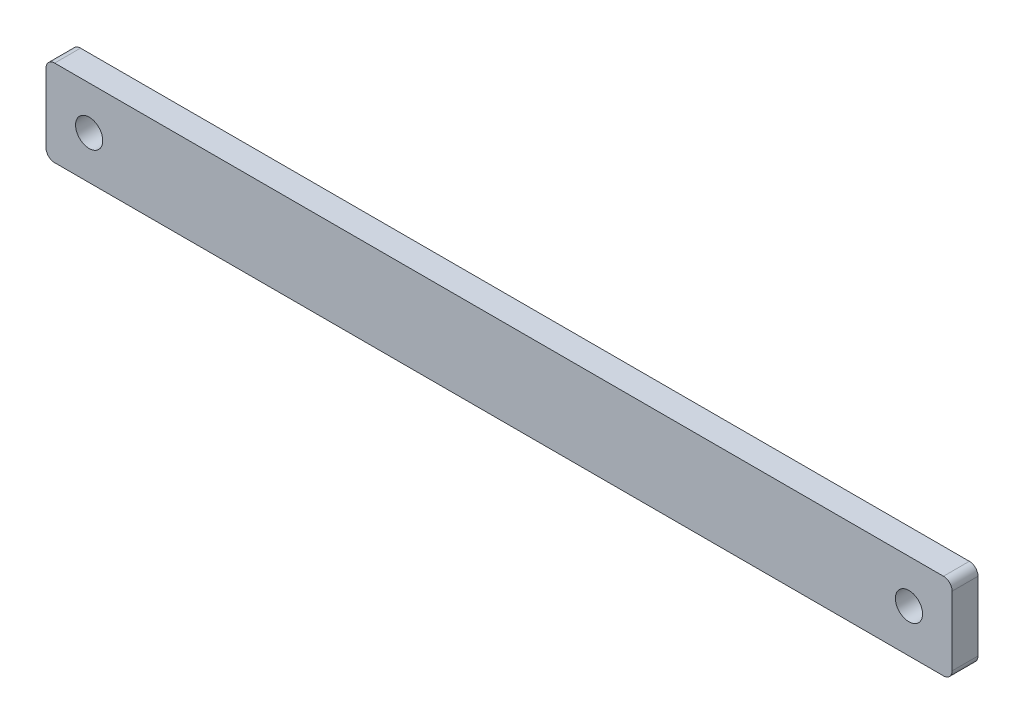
ISO-10303-21;
HEADER;
FILE_DESCRIPTION(('STEP AP214'),'2;1');
FILE_NAME('part.step','',(''),(''),'','','');
FILE_SCHEMA(('AUTOMOTIVE_DESIGN { 1 0 10303 214 1 1 1 1 }'));
ENDSEC;
DATA;
#1=APPLICATION_CONTEXT('core data for automotive mechanical design processes');
#2=APPLICATION_PROTOCOL_DEFINITION('international standard','automotive_design',2000,#1);
#3=PRODUCT_CONTEXT('',#1,'mechanical');
#4=PRODUCT('Part','Part','',(#3));
#5=PRODUCT_RELATED_PRODUCT_CATEGORY('part','',(#4));
#6=PRODUCT_DEFINITION_FORMATION('','',#4);
#7=PRODUCT_DEFINITION_CONTEXT('part definition',#1,'design');
#8=PRODUCT_DEFINITION('design','',#6,#7);
#9=PRODUCT_DEFINITION_SHAPE('','',#8);
#10=(LENGTH_UNIT() NAMED_UNIT(*) SI_UNIT(.MILLI.,.METRE.));
#11=(NAMED_UNIT(*) PLANE_ANGLE_UNIT() SI_UNIT($,.RADIAN.));
#12=(NAMED_UNIT(*) SI_UNIT($,.STERADIAN.) SOLID_ANGLE_UNIT());
#13=UNCERTAINTY_MEASURE_WITH_UNIT(LENGTH_MEASURE(1.E-05),#10,'distance_accuracy_value','');
#14=(GEOMETRIC_REPRESENTATION_CONTEXT(3) GLOBAL_UNCERTAINTY_ASSIGNED_CONTEXT((#13)) GLOBAL_UNIT_ASSIGNED_CONTEXT((#10,
#11,#12)) REPRESENTATION_CONTEXT('',''));
#15=CARTESIAN_POINT('',(0.,0.,0.));
#16=DIRECTION('',(0.,0.,1.));
#17=DIRECTION('',(1.,0.,0.));
#18=AXIS2_PLACEMENT_3D('',#15,#16,#17);
#19=CARTESIAN_POINT('',(0.,0.,7.62));
#20=DIRECTION('',(1.,0.,0.));
#21=DIRECTION('',(0.,0.,-1.));
#22=AXIS2_PLACEMENT_3D('',#19,#20,#21);
#23=PLANE('',#22);
#24=DIRECTION('',(0.,-1.,0.));
#25=VECTOR('',#24,1.);
#26=CARTESIAN_POINT('',(0.,0.,7.62));
#27=LINE('',#26,#25);
#28=CARTESIAN_POINT('',(0.,22.86,7.62));
#29=VERTEX_POINT('',#28);
#30=CARTESIAN_POINT('',(0.,2.54,7.62));
#31=VERTEX_POINT('',#30);
#32=EDGE_CURVE('E130',#29,#31,#27,.T.);
#33=ORIENTED_EDGE('',*,*,#32,.F.);
#34=DIRECTION('',(0.,0.,-1.));
#35=VECTOR('',#34,1.);
#36=CARTESIAN_POINT('',(0.,22.86,7.62));
#37=LINE('',#36,#35);
#38=CARTESIAN_POINT('',(0.,22.86,0.));
#39=VERTEX_POINT('',#38);
#40=EDGE_CURVE('E114',#29,#39,#37,.T.);
#41=ORIENTED_EDGE('',*,*,#40,.T.);
#42=DIRECTION('',(0.,-1.,0.));
#43=VECTOR('',#42,1.);
#44=CARTESIAN_POINT('',(0.,0.,0.));
#45=LINE('',#44,#43);
#46=CARTESIAN_POINT('',(0.,2.54,0.));
#47=VERTEX_POINT('',#46);
#48=EDGE_CURVE('E127',#39,#47,#45,.T.);
#49=ORIENTED_EDGE('',*,*,#48,.T.);
#50=DIRECTION('',(0.,0.,-1.));
#51=VECTOR('',#50,1.);
#52=CARTESIAN_POINT('',(0.,2.54,7.62));
#53=LINE('',#52,#51);
#54=EDGE_CURVE('E133',#47,#31,#53,.F.);
#55=ORIENTED_EDGE('',*,*,#54,.T.);
#56=EDGE_LOOP('',(#33,#41,#49,#55));
#57=FACE_BOUND('',#56,.T.);
#58=ADVANCED_FACE('F43',(#57),#23,.F.);
#59=CARTESIAN_POINT('',(0.,0.,7.62));
#60=DIRECTION('',(0.,1.,0.));
#61=DIRECTION('',(0.,0.,1.));
#62=AXIS2_PLACEMENT_3D('',#59,#60,#61);
#63=PLANE('',#62);
#64=DIRECTION('',(1.,0.,0.));
#65=VECTOR('',#64,1.);
#66=CARTESIAN_POINT('',(0.,0.,7.62));
#67=LINE('',#66,#65);
#68=CARTESIAN_POINT('',(2.54,0.,7.62));
#69=VERTEX_POINT('',#68);
#70=CARTESIAN_POINT('',(264.16,0.,7.62));
#71=VERTEX_POINT('',#70);
#72=EDGE_CURVE('E195',#69,#71,#67,.T.);
#73=ORIENTED_EDGE('',*,*,#72,.F.);
#74=DIRECTION('',(0.,0.,-1.));
#75=VECTOR('',#74,1.);
#76=CARTESIAN_POINT('',(2.54,0.,7.62));
#77=LINE('',#76,#75);
#78=CARTESIAN_POINT('',(2.54,0.,0.));
#79=VERTEX_POINT('',#78);
#80=EDGE_CURVE('E186',#69,#79,#77,.T.);
#81=ORIENTED_EDGE('',*,*,#80,.T.);
#82=DIRECTION('',(1.,0.,0.));
#83=VECTOR('',#82,1.);
#84=CARTESIAN_POINT('',(0.,0.,0.));
#85=LINE('',#84,#83);
#86=CARTESIAN_POINT('',(264.16,0.,0.));
#87=VERTEX_POINT('',#86);
#88=EDGE_CURVE('E138',#79,#87,#85,.T.);
#89=ORIENTED_EDGE('',*,*,#88,.T.);
#90=DIRECTION('',(0.,0.,-1.));
#91=VECTOR('',#90,1.);
#92=CARTESIAN_POINT('',(264.16,0.,7.62));
#93=LINE('',#92,#91);
#94=EDGE_CURVE('E183',#87,#71,#93,.F.);
#95=ORIENTED_EDGE('',*,*,#94,.T.);
#96=EDGE_LOOP('',(#73,#81,#89,#95));
#97=FACE_BOUND('',#96,.T.);
#98=ADVANCED_FACE('F245',(#97),#63,.F.);
#99=CARTESIAN_POINT('',(266.7,0.,7.62));
#100=DIRECTION('',(-1.,0.,0.));
#101=DIRECTION('',(0.,0.,1.));
#102=AXIS2_PLACEMENT_3D('',#99,#100,#101);
#103=PLANE('',#102);
#104=DIRECTION('',(0.,1.,0.));
#105=VECTOR('',#104,1.);
#106=CARTESIAN_POINT('',(266.7,0.,7.62));
#107=LINE('',#106,#105);
#108=CARTESIAN_POINT('',(266.7,2.54,7.62));
#109=VERTEX_POINT('',#108);
#110=CARTESIAN_POINT('',(266.7,22.86,7.62));
#111=VERTEX_POINT('',#110);
#112=EDGE_CURVE('E193',#109,#111,#107,.T.);
#113=ORIENTED_EDGE('',*,*,#112,.F.);
#114=DIRECTION('',(0.,0.,-1.));
#115=VECTOR('',#114,1.);
#116=CARTESIAN_POINT('',(266.7,2.54,7.62));
#117=LINE('',#116,#115);
#118=CARTESIAN_POINT('',(266.7,2.54,0.));
#119=VERTEX_POINT('',#118);
#120=EDGE_CURVE('E11',#109,#119,#117,.T.);
#121=ORIENTED_EDGE('',*,*,#120,.T.);
#122=DIRECTION('',(0.,1.,0.));
#123=VECTOR('',#122,1.);
#124=CARTESIAN_POINT('',(266.7,0.,0.));
#125=LINE('',#124,#123);
#126=CARTESIAN_POINT('',(266.7,22.86,0.));
#127=VERTEX_POINT('',#126);
#128=EDGE_CURVE('E144',#119,#127,#125,.T.);
#129=ORIENTED_EDGE('',*,*,#128,.T.);
#130=DIRECTION('',(0.,0.,-1.));
#131=VECTOR('',#130,1.);
#132=CARTESIAN_POINT('',(266.7,22.86,7.62));
#133=LINE('',#132,#131);
#134=EDGE_CURVE('E52',#127,#111,#133,.F.);
#135=ORIENTED_EDGE('',*,*,#134,.T.);
#136=EDGE_LOOP('',(#113,#121,#129,#135));
#137=FACE_BOUND('',#136,.T.);
#138=ADVANCED_FACE('F238',(#137),#103,.F.);
#139=CARTESIAN_POINT('',(0.,25.4,7.62));
#140=DIRECTION('',(0.,-1.,0.));
#141=DIRECTION('',(0.,0.,-1.));
#142=AXIS2_PLACEMENT_3D('',#139,#140,#141);
#143=PLANE('',#142);
#144=DIRECTION('',(-1.,0.,0.));
#145=VECTOR('',#144,1.);
#146=CARTESIAN_POINT('',(0.,25.4,0.));
#147=LINE('',#146,#145);
#148=CARTESIAN_POINT('',(264.16,25.4,0.));
#149=VERTEX_POINT('',#148);
#150=CARTESIAN_POINT('',(2.54,25.4,0.));
#151=VERTEX_POINT('',#150);
#152=EDGE_CURVE('E155',#149,#151,#147,.T.);
#153=ORIENTED_EDGE('',*,*,#152,.T.);
#154=DIRECTION('',(0.,0.,-1.));
#155=VECTOR('',#154,1.);
#156=CARTESIAN_POINT('',(2.54,25.4,7.62));
#157=LINE('',#156,#155);
#158=CARTESIAN_POINT('',(2.54,25.4,7.62));
#159=VERTEX_POINT('',#158);
#160=EDGE_CURVE('E115',#151,#159,#157,.F.);
#161=ORIENTED_EDGE('',*,*,#160,.T.);
#162=DIRECTION('',(-1.,0.,0.));
#163=VECTOR('',#162,1.);
#164=CARTESIAN_POINT('',(0.,25.4,7.62));
#165=LINE('',#164,#163);
#166=CARTESIAN_POINT('',(264.16,25.4,7.62));
#167=VERTEX_POINT('',#166);
#168=EDGE_CURVE('E150',#167,#159,#165,.T.);
#169=ORIENTED_EDGE('',*,*,#168,.F.);
#170=DIRECTION('',(0.,0.,-1.));
#171=VECTOR('',#170,1.);
#172=CARTESIAN_POINT('',(264.16,25.4,7.62));
#173=LINE('',#172,#171);
#174=EDGE_CURVE('E121',#167,#149,#173,.T.);
#175=ORIENTED_EDGE('',*,*,#174,.T.);
#176=EDGE_LOOP('',(#153,#161,#169,#175));
#177=FACE_BOUND('',#176,.T.);
#178=ADVANCED_FACE('F229',(#177),#143,.F.);
#179=CARTESIAN_POINT('',(0.,0.,7.62));
#180=DIRECTION('',(0.,0.,-1.));
#181=DIRECTION('',(-1.,0.,0.));
#182=AXIS2_PLACEMENT_3D('',#179,#180,#181);
#183=PLANE('',#182);
#184=CARTESIAN_POINT('',(254.,12.6999999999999,7.62));
#185=DIRECTION('',(0.,0.,-1.));
#186=DIRECTION('',(-1.,0.,0.));
#187=AXIS2_PLACEMENT_3D('',#184,#185,#186);
#188=CIRCLE('',#187,4.);
#189=CARTESIAN_POINT('',(258.,12.6999999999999,7.62));
#190=VERTEX_POINT('',#189);
#191=EDGE_CURVE('E205',#190,#190,#188,.T.);
#192=ORIENTED_EDGE('',*,*,#191,.T.);
#193=EDGE_LOOP('',(#192));
#194=FACE_BOUND('',#193,.T.);
#195=CARTESIAN_POINT('',(12.7,12.6999999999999,7.62));
#196=DIRECTION('',(0.,0.,1.));
#197=DIRECTION('',(1.,0.,0.));
#198=AXIS2_PLACEMENT_3D('',#195,#196,#197);
#199=CIRCLE('',#198,4.);
#200=CARTESIAN_POINT('',(16.7,12.6999999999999,7.62));
#201=VERTEX_POINT('',#200);
#202=EDGE_CURVE('E147',#201,#201,#199,.T.);
#203=ORIENTED_EDGE('',*,*,#202,.F.);
#204=EDGE_LOOP('',(#203));
#205=FACE_BOUND('',#204,.T.);
#206=ORIENTED_EDGE('',*,*,#168,.T.);
#207=CARTESIAN_POINT('',(2.54,22.86,7.62));
#208=DIRECTION('',(0.,0.,-1.));
#209=DIRECTION('',(-1.,0.,0.));
#210=AXIS2_PLACEMENT_3D('',#207,#208,#209);
#211=CIRCLE('',#210,2.54);
#212=EDGE_CURVE('E180',#159,#29,#211,.F.);
#213=ORIENTED_EDGE('',*,*,#212,.T.);
#214=ORIENTED_EDGE('',*,*,#32,.T.);
#215=CARTESIAN_POINT('',(2.54,2.54,7.62));
#216=DIRECTION('',(0.,0.,-1.));
#217=DIRECTION('',(-1.,0.,0.));
#218=AXIS2_PLACEMENT_3D('',#215,#216,#217);
#219=CIRCLE('',#218,2.54);
#220=EDGE_CURVE('E177',#31,#69,#219,.F.);
#221=ORIENTED_EDGE('',*,*,#220,.T.);
#222=ORIENTED_EDGE('',*,*,#72,.T.);
#223=CARTESIAN_POINT('',(264.16,2.54,7.62));
#224=DIRECTION('',(0.,0.,-1.));
#225=DIRECTION('',(-1.,0.,0.));
#226=AXIS2_PLACEMENT_3D('',#223,#224,#225);
#227=CIRCLE('',#226,2.54);
#228=EDGE_CURVE('E65',#71,#109,#227,.F.);
#229=ORIENTED_EDGE('',*,*,#228,.T.);
#230=ORIENTED_EDGE('',*,*,#112,.T.);
#231=CARTESIAN_POINT('',(264.16,22.86,7.62));
#232=DIRECTION('',(0.,0.,-1.));
#233=DIRECTION('',(-1.,0.,0.));
#234=AXIS2_PLACEMENT_3D('',#231,#232,#233);
#235=CIRCLE('',#234,2.54);
#236=EDGE_CURVE('E172',#111,#167,#235,.F.);
#237=ORIENTED_EDGE('',*,*,#236,.T.);
#238=EDGE_LOOP('',(#206,#213,#214,#221,#222,#229,#230,#237));
#239=FACE_BOUND('',#238,.T.);
#240=ADVANCED_FACE('F219',(#194,#205,#239),#183,.F.);
#241=CARTESIAN_POINT('',(0.,0.,0.));
#242=DIRECTION('',(0.,0.,-1.));
#243=DIRECTION('',(-1.,0.,0.));
#244=AXIS2_PLACEMENT_3D('',#241,#242,#243);
#245=PLANE('',#244);
#246=CARTESIAN_POINT('',(254.,12.6999999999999,0.));
#247=DIRECTION('',(0.,0.,-1.));
#248=DIRECTION('',(-1.,0.,0.));
#249=AXIS2_PLACEMENT_3D('',#246,#247,#248);
#250=CIRCLE('',#249,4.);
#251=CARTESIAN_POINT('',(258.,12.6999999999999,0.));
#252=VERTEX_POINT('',#251);
#253=EDGE_CURVE('E203',#252,#252,#250,.T.);
#254=ORIENTED_EDGE('',*,*,#253,.F.);
#255=EDGE_LOOP('',(#254));
#256=FACE_BOUND('',#255,.T.);
#257=CARTESIAN_POINT('',(12.7,12.6999999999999,0.));
#258=DIRECTION('',(0.,0.,1.));
#259=DIRECTION('',(1.,0.,0.));
#260=AXIS2_PLACEMENT_3D('',#257,#258,#259);
#261=CIRCLE('',#260,4.);
#262=CARTESIAN_POINT('',(16.7,12.6999999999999,0.));
#263=VERTEX_POINT('',#262);
#264=EDGE_CURVE('E139',#263,#263,#261,.T.);
#265=ORIENTED_EDGE('',*,*,#264,.T.);
#266=EDGE_LOOP('',(#265));
#267=FACE_BOUND('',#266,.T.);
#268=ORIENTED_EDGE('',*,*,#48,.F.);
#269=CARTESIAN_POINT('',(2.54,22.86,0.));
#270=DIRECTION('',(0.,0.,-1.));
#271=DIRECTION('',(-1.,0.,0.));
#272=AXIS2_PLACEMENT_3D('',#269,#270,#271);
#273=CIRCLE('',#272,2.54);
#274=EDGE_CURVE('E110',#39,#151,#273,.T.);
#275=ORIENTED_EDGE('',*,*,#274,.T.);
#276=ORIENTED_EDGE('',*,*,#152,.F.);
#277=CARTESIAN_POINT('',(264.16,22.86,0.));
#278=DIRECTION('',(0.,0.,-1.));
#279=DIRECTION('',(-1.,0.,0.));
#280=AXIS2_PLACEMENT_3D('',#277,#278,#279);
#281=CIRCLE('',#280,2.54);
#282=EDGE_CURVE('E132',#149,#127,#281,.T.);
#283=ORIENTED_EDGE('',*,*,#282,.T.);
#284=ORIENTED_EDGE('',*,*,#128,.F.);
#285=CARTESIAN_POINT('',(264.16,2.54,0.));
#286=DIRECTION('',(0.,0.,-1.));
#287=DIRECTION('',(-1.,0.,0.));
#288=AXIS2_PLACEMENT_3D('',#285,#286,#287);
#289=CIRCLE('',#288,2.54);
#290=EDGE_CURVE('E162',#119,#87,#289,.T.);
#291=ORIENTED_EDGE('',*,*,#290,.T.);
#292=ORIENTED_EDGE('',*,*,#88,.F.);
#293=CARTESIAN_POINT('',(2.54,2.54,0.));
#294=DIRECTION('',(0.,0.,-1.));
#295=DIRECTION('',(-1.,0.,0.));
#296=AXIS2_PLACEMENT_3D('',#293,#294,#295);
#297=CIRCLE('',#296,2.54);
#298=EDGE_CURVE('E122',#79,#47,#297,.T.);
#299=ORIENTED_EDGE('',*,*,#298,.T.);
#300=EDGE_LOOP('',(#268,#275,#276,#283,#284,#291,#292,#299));
#301=FACE_BOUND('',#300,.T.);
#302=ADVANCED_FACE('F135',(#256,#267,#301),#245,.T.);
#303=CARTESIAN_POINT('',(12.7,12.6999999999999,0.));
#304=DIRECTION('',(0.,0.,1.));
#305=DIRECTION('',(1.,0.,0.));
#306=AXIS2_PLACEMENT_3D('',#303,#304,#305);
#307=CYLINDRICAL_SURFACE('',#306,4.);
#308=CARTESIAN_POINT('',(16.7,12.6999999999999,0.));
#309=CARTESIAN_POINT('',(16.7,12.6999999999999,0.0793749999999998));
#310=CARTESIAN_POINT('',(16.7,12.6999999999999,0.15875));
#311=CARTESIAN_POINT('',(16.7,12.6999999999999,0.3175));
#312=CARTESIAN_POINT('',(16.7,12.6999999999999,0.396875));
#313=CARTESIAN_POINT('',(16.7,12.6999999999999,0.555625));
#314=CARTESIAN_POINT('',(16.7,12.6999999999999,0.635));
#315=CARTESIAN_POINT('',(16.7,12.6999999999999,0.79375));
#316=CARTESIAN_POINT('',(16.7,12.6999999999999,0.873125));
#317=CARTESIAN_POINT('',(16.7,12.6999999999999,1.031875));
#318=CARTESIAN_POINT('',(16.7,12.6999999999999,1.11125));
#319=CARTESIAN_POINT('',(16.7,12.6999999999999,1.27));
#320=CARTESIAN_POINT('',(16.7,12.6999999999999,1.349375));
#321=CARTESIAN_POINT('',(16.7,12.6999999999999,1.508125));
#322=CARTESIAN_POINT('',(16.7,12.6999999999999,1.5875));
#323=CARTESIAN_POINT('',(16.7,12.6999999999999,1.74625));
#324=CARTESIAN_POINT('',(16.7,12.6999999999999,1.825625));
#325=CARTESIAN_POINT('',(16.7,12.6999999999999,1.984375));
#326=CARTESIAN_POINT('',(16.7,12.6999999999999,2.06375));
#327=CARTESIAN_POINT('',(16.7,12.6999999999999,2.2225));
#328=CARTESIAN_POINT('',(16.7,12.6999999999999,2.301875));
#329=CARTESIAN_POINT('',(16.7,12.6999999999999,2.460625));
#330=CARTESIAN_POINT('',(16.7,12.6999999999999,2.54));
#331=CARTESIAN_POINT('',(16.7,12.6999999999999,2.69875));
#332=CARTESIAN_POINT('',(16.7,12.6999999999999,2.778125));
#333=CARTESIAN_POINT('',(16.7,12.6999999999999,2.936875));
#334=CARTESIAN_POINT('',(16.7,12.6999999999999,3.01625));
#335=CARTESIAN_POINT('',(16.7,12.6999999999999,3.175));
#336=CARTESIAN_POINT('',(16.7,12.6999999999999,3.254375));
#337=CARTESIAN_POINT('',(16.7,12.6999999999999,3.413125));
#338=CARTESIAN_POINT('',(16.7,12.6999999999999,3.4925));
#339=CARTESIAN_POINT('',(16.7,12.6999999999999,3.65125));
#340=CARTESIAN_POINT('',(16.7,12.6999999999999,3.730625));
#341=CARTESIAN_POINT('',(16.7,12.6999999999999,3.889375));
#342=CARTESIAN_POINT('',(16.7,12.6999999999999,3.96875));
#343=CARTESIAN_POINT('',(16.7,12.6999999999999,4.1275));
#344=CARTESIAN_POINT('',(16.7,12.6999999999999,4.206875));
#345=CARTESIAN_POINT('',(16.7,12.6999999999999,4.365625));
#346=CARTESIAN_POINT('',(16.7,12.6999999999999,4.445));
#347=CARTESIAN_POINT('',(16.7,12.6999999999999,4.60375));
#348=CARTESIAN_POINT('',(16.7,12.6999999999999,4.683125));
#349=CARTESIAN_POINT('',(16.7,12.6999999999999,4.841875));
#350=CARTESIAN_POINT('',(16.7,12.6999999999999,4.92125));
#351=CARTESIAN_POINT('',(16.7,12.6999999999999,5.08));
#352=CARTESIAN_POINT('',(16.7,12.6999999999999,5.159375));
#353=CARTESIAN_POINT('',(16.7,12.6999999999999,5.318125));
#354=CARTESIAN_POINT('',(16.7,12.6999999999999,5.3975));
#355=CARTESIAN_POINT('',(16.7,12.6999999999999,5.55625));
#356=CARTESIAN_POINT('',(16.7,12.6999999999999,5.635625));
#357=CARTESIAN_POINT('',(16.7,12.6999999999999,5.794375));
#358=CARTESIAN_POINT('',(16.7,12.6999999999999,5.87375));
#359=CARTESIAN_POINT('',(16.7,12.6999999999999,6.0325));
#360=CARTESIAN_POINT('',(16.7,12.6999999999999,6.111875));
#361=CARTESIAN_POINT('',(16.7,12.6999999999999,6.270625));
#362=CARTESIAN_POINT('',(16.7,12.6999999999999,6.35));
#363=CARTESIAN_POINT('',(16.7,12.6999999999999,6.50875));
#364=CARTESIAN_POINT('',(16.7,12.6999999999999,6.588125));
#365=CARTESIAN_POINT('',(16.7,12.6999999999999,6.746875));
#366=CARTESIAN_POINT('',(16.7,12.6999999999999,6.82625));
#367=CARTESIAN_POINT('',(16.7,12.6999999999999,6.985));
#368=CARTESIAN_POINT('',(16.7,12.6999999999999,7.064375));
#369=CARTESIAN_POINT('',(16.7,12.6999999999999,7.223125));
#370=CARTESIAN_POINT('',(16.7,12.6999999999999,7.3025));
#371=CARTESIAN_POINT('',(16.7,12.6999999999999,7.46125));
#372=CARTESIAN_POINT('',(16.7,12.6999999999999,7.540625));
#373=CARTESIAN_POINT('',(16.7,12.6999999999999,7.62));
#374=B_SPLINE_CURVE_WITH_KNOTS('',3,(#308,#309,#310,#311,#312,#313,#314,#315,#316,#317,#318,
#319,#320,#321,#322,#323,#324,#325,#326,#327,#328,#329,#330,#331,#332,#333,#334,#335,#336,#337,
#338,#339,#340,#341,#342,#343,#344,#345,#346,#347,#348,#349,#350,#351,#352,#353,#354,#355,#356,
#357,#358,#359,#360,#361,#362,#363,#364,#365,#366,#367,#368,#369,#370,#371,#372,#373),
.UNSPECIFIED.,.F.,.F.,(4,2,2,2,2,2,2,2,2,2,2,2,2,2,2,2,2,2,2,2,2,2,2,2,2,2,2,2,2,2,2,2,4),(0.,
0.238125,0.47625,0.714375,0.9525,1.190625,1.42875,1.666875,1.905,2.143125,2.38125,2.619375,
2.8575,3.095625,3.33375,3.571875,3.81,4.048125,4.28625,4.524375,4.7625,5.000625,5.23875,
5.476875,5.715,5.953125,6.19125,6.429375,6.6675,6.905625,7.14375,7.381875,7.62),.UNSPECIFIED.);
#375=EDGE_CURVE('BSEAM218',#263,#201,#374,.T.);
#376=ORIENTED_EDGE('',*,*,#264,.F.);
#377=ORIENTED_EDGE('',*,*,#202,.T.);
#378=ORIENTED_EDGE('',*,*,#375,.T.);
#379=ORIENTED_EDGE('',*,*,#375,.F.);
#380=EDGE_LOOP('',(#376,#378,#377,#379));
#381=FACE_BOUND('',#380,.T.);
#382=ADVANCED_FACE('F218',(#381),#307,.F.);
#383=CARTESIAN_POINT('',(254.,12.6999999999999,0.));
#384=DIRECTION('',(0.,0.,1.));
#385=DIRECTION('',(1.,0.,0.));
#386=AXIS2_PLACEMENT_3D('',#383,#384,#385);
#387=CYLINDRICAL_SURFACE('',#386,4.);
#388=CARTESIAN_POINT('',(258.,12.6999999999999,0.));
#389=CARTESIAN_POINT('',(258.,12.6999999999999,0.0793749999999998));
#390=CARTESIAN_POINT('',(258.,12.6999999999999,0.15875));
#391=CARTESIAN_POINT('',(258.,12.6999999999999,0.3175));
#392=CARTESIAN_POINT('',(258.,12.6999999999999,0.396875));
#393=CARTESIAN_POINT('',(258.,12.6999999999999,0.555625));
#394=CARTESIAN_POINT('',(258.,12.6999999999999,0.635));
#395=CARTESIAN_POINT('',(258.,12.6999999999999,0.79375));
#396=CARTESIAN_POINT('',(258.,12.6999999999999,0.873125));
#397=CARTESIAN_POINT('',(258.,12.6999999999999,1.031875));
#398=CARTESIAN_POINT('',(258.,12.6999999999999,1.11125));
#399=CARTESIAN_POINT('',(258.,12.6999999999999,1.27));
#400=CARTESIAN_POINT('',(258.,12.6999999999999,1.349375));
#401=CARTESIAN_POINT('',(258.,12.6999999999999,1.508125));
#402=CARTESIAN_POINT('',(258.,12.6999999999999,1.5875));
#403=CARTESIAN_POINT('',(258.,12.6999999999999,1.74625));
#404=CARTESIAN_POINT('',(258.,12.6999999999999,1.825625));
#405=CARTESIAN_POINT('',(258.,12.6999999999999,1.984375));
#406=CARTESIAN_POINT('',(258.,12.6999999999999,2.06375));
#407=CARTESIAN_POINT('',(258.,12.6999999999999,2.2225));
#408=CARTESIAN_POINT('',(258.,12.6999999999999,2.301875));
#409=CARTESIAN_POINT('',(258.,12.6999999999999,2.460625));
#410=CARTESIAN_POINT('',(258.,12.6999999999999,2.54));
#411=CARTESIAN_POINT('',(258.,12.6999999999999,2.69875));
#412=CARTESIAN_POINT('',(258.,12.6999999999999,2.778125));
#413=CARTESIAN_POINT('',(258.,12.6999999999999,2.936875));
#414=CARTESIAN_POINT('',(258.,12.6999999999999,3.01625));
#415=CARTESIAN_POINT('',(258.,12.6999999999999,3.175));
#416=CARTESIAN_POINT('',(258.,12.6999999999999,3.254375));
#417=CARTESIAN_POINT('',(258.,12.6999999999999,3.413125));
#418=CARTESIAN_POINT('',(258.,12.6999999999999,3.4925));
#419=CARTESIAN_POINT('',(258.,12.6999999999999,3.65125));
#420=CARTESIAN_POINT('',(258.,12.6999999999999,3.730625));
#421=CARTESIAN_POINT('',(258.,12.6999999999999,3.889375));
#422=CARTESIAN_POINT('',(258.,12.6999999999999,3.96875));
#423=CARTESIAN_POINT('',(258.,12.6999999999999,4.1275));
#424=CARTESIAN_POINT('',(258.,12.6999999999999,4.206875));
#425=CARTESIAN_POINT('',(258.,12.6999999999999,4.365625));
#426=CARTESIAN_POINT('',(258.,12.6999999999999,4.445));
#427=CARTESIAN_POINT('',(258.,12.6999999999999,4.60375));
#428=CARTESIAN_POINT('',(258.,12.6999999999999,4.683125));
#429=CARTESIAN_POINT('',(258.,12.6999999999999,4.841875));
#430=CARTESIAN_POINT('',(258.,12.6999999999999,4.92125));
#431=CARTESIAN_POINT('',(258.,12.6999999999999,5.08));
#432=CARTESIAN_POINT('',(258.,12.6999999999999,5.159375));
#433=CARTESIAN_POINT('',(258.,12.6999999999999,5.318125));
#434=CARTESIAN_POINT('',(258.,12.6999999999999,5.3975));
#435=CARTESIAN_POINT('',(258.,12.6999999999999,5.55625));
#436=CARTESIAN_POINT('',(258.,12.6999999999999,5.635625));
#437=CARTESIAN_POINT('',(258.,12.6999999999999,5.794375));
#438=CARTESIAN_POINT('',(258.,12.6999999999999,5.87375));
#439=CARTESIAN_POINT('',(258.,12.6999999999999,6.0325));
#440=CARTESIAN_POINT('',(258.,12.6999999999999,6.111875));
#441=CARTESIAN_POINT('',(258.,12.6999999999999,6.270625));
#442=CARTESIAN_POINT('',(258.,12.6999999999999,6.35));
#443=CARTESIAN_POINT('',(258.,12.6999999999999,6.50875));
#444=CARTESIAN_POINT('',(258.,12.6999999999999,6.588125));
#445=CARTESIAN_POINT('',(258.,12.6999999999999,6.746875));
#446=CARTESIAN_POINT('',(258.,12.6999999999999,6.82625));
#447=CARTESIAN_POINT('',(258.,12.6999999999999,6.985));
#448=CARTESIAN_POINT('',(258.,12.6999999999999,7.064375));
#449=CARTESIAN_POINT('',(258.,12.6999999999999,7.223125));
#450=CARTESIAN_POINT('',(258.,12.6999999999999,7.3025));
#451=CARTESIAN_POINT('',(258.,12.6999999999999,7.46125));
#452=CARTESIAN_POINT('',(258.,12.6999999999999,7.540625));
#453=CARTESIAN_POINT('',(258.,12.6999999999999,7.62));
#454=B_SPLINE_CURVE_WITH_KNOTS('',3,(#388,#389,#390,#391,#392,#393,#394,#395,#396,#397,#398,
#399,#400,#401,#402,#403,#404,#405,#406,#407,#408,#409,#410,#411,#412,#413,#414,#415,#416,#417,
#418,#419,#420,#421,#422,#423,#424,#425,#426,#427,#428,#429,#430,#431,#432,#433,#434,#435,#436,
#437,#438,#439,#440,#441,#442,#443,#444,#445,#446,#447,#448,#449,#450,#451,#452,#453),
.UNSPECIFIED.,.F.,.F.,(4,2,2,2,2,2,2,2,2,2,2,2,2,2,2,2,2,2,2,2,2,2,2,2,2,2,2,2,2,2,2,2,4),(0.,
0.238125,0.47625,0.714375,0.9525,1.190625,1.42875,1.666875,1.905,2.143125,2.38125,2.619375,
2.8575,3.095625,3.33375,3.571875,3.81,4.048125,4.28625,4.524375,4.7625,5.000625,5.23875,
5.476875,5.715,5.953125,6.19125,6.429375,6.6675,6.905625,7.14375,7.381875,7.62),.UNSPECIFIED.);
#455=EDGE_CURVE('BSEAM213',#252,#190,#454,.T.);
#456=ORIENTED_EDGE('',*,*,#253,.T.);
#457=ORIENTED_EDGE('',*,*,#191,.F.);
#458=ORIENTED_EDGE('',*,*,#455,.T.);
#459=ORIENTED_EDGE('',*,*,#455,.F.);
#460=EDGE_LOOP('',(#456,#458,#457,#459));
#461=FACE_BOUND('',#460,.T.);
#462=ADVANCED_FACE('F213',(#461),#387,.F.);
#463=CARTESIAN_POINT('',(2.54,22.86,7.62));
#464=DIRECTION('',(0.,0.,-1.));
#465=DIRECTION('',(-1.,0.,0.));
#466=AXIS2_PLACEMENT_3D('',#463,#464,#465);
#467=CYLINDRICAL_SURFACE('',#466,2.54);
#468=ORIENTED_EDGE('',*,*,#212,.F.);
#469=ORIENTED_EDGE('',*,*,#160,.F.);
#470=ORIENTED_EDGE('',*,*,#274,.F.);
#471=ORIENTED_EDGE('',*,*,#40,.F.);
#472=EDGE_LOOP('',(#468,#469,#470,#471));
#473=FACE_BOUND('',#472,.T.);
#474=ADVANCED_FACE('F113',(#473),#467,.T.);
#475=CARTESIAN_POINT('',(2.54,2.54,7.62));
#476=DIRECTION('',(0.,0.,-1.));
#477=DIRECTION('',(-1.,0.,0.));
#478=AXIS2_PLACEMENT_3D('',#475,#476,#477);
#479=CYLINDRICAL_SURFACE('',#478,2.54);
#480=ORIENTED_EDGE('',*,*,#220,.F.);
#481=ORIENTED_EDGE('',*,*,#54,.F.);
#482=ORIENTED_EDGE('',*,*,#298,.F.);
#483=ORIENTED_EDGE('',*,*,#80,.F.);
#484=EDGE_LOOP('',(#480,#481,#482,#483));
#485=FACE_BOUND('',#484,.T.);
#486=ADVANCED_FACE('F248',(#485),#479,.T.);
#487=CARTESIAN_POINT('',(264.16,2.54,7.62));
#488=DIRECTION('',(0.,0.,-1.));
#489=DIRECTION('',(-1.,0.,0.));
#490=AXIS2_PLACEMENT_3D('',#487,#488,#489);
#491=CYLINDRICAL_SURFACE('',#490,2.54);
#492=ORIENTED_EDGE('',*,*,#228,.F.);
#493=ORIENTED_EDGE('',*,*,#94,.F.);
#494=ORIENTED_EDGE('',*,*,#290,.F.);
#495=ORIENTED_EDGE('',*,*,#120,.F.);
#496=EDGE_LOOP('',(#492,#493,#494,#495));
#497=FACE_BOUND('',#496,.T.);
#498=ADVANCED_FACE('F241',(#497),#491,.T.);
#499=CARTESIAN_POINT('',(264.16,22.86,7.62));
#500=DIRECTION('',(0.,0.,-1.));
#501=DIRECTION('',(-1.,0.,0.));
#502=AXIS2_PLACEMENT_3D('',#499,#500,#501);
#503=CYLINDRICAL_SURFACE('',#502,2.54);
#504=ORIENTED_EDGE('',*,*,#236,.F.);
#505=ORIENTED_EDGE('',*,*,#134,.F.);
#506=ORIENTED_EDGE('',*,*,#282,.F.);
#507=ORIENTED_EDGE('',*,*,#174,.F.);
#508=EDGE_LOOP('',(#504,#505,#506,#507));
#509=FACE_BOUND('',#508,.T.);
#510=ADVANCED_FACE('F45',(#509),#503,.T.);
#511=CLOSED_SHELL('',(#58,#98,#138,#178,#240,#302,#382,#462,#474,#486,#498,#510));
#512=MANIFOLD_SOLID_BREP('B2',#511);
#513=ADVANCED_BREP_SHAPE_REPRESENTATION('',(#18,#512),#14);
#514=SHAPE_DEFINITION_REPRESENTATION(#9,#513);
ENDSEC;
END-ISO-10303-21;
